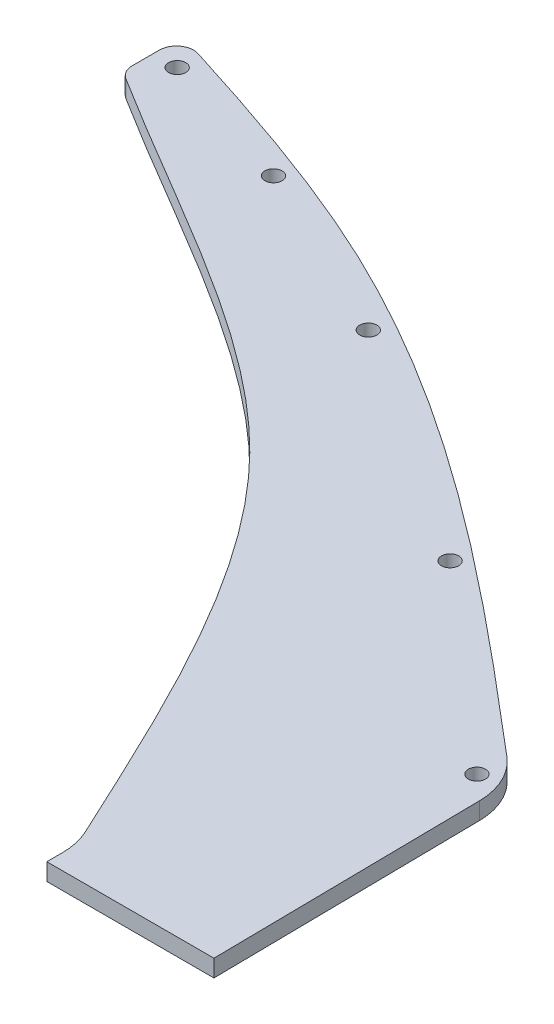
ISO-10303-21;
HEADER;
FILE_DESCRIPTION(('STEP AP214'),'2;1');
FILE_NAME('part.step','',(''),(''),'','','');
FILE_SCHEMA(('AUTOMOTIVE_DESIGN { 1 0 10303 214 1 1 1 1 }'));
ENDSEC;
DATA;
#1=APPLICATION_CONTEXT('core data for automotive mechanical design processes');
#2=APPLICATION_PROTOCOL_DEFINITION('international standard','automotive_design',2000,#1);
#3=PRODUCT_CONTEXT('',#1,'mechanical');
#4=PRODUCT('Part','Part','',(#3));
#5=PRODUCT_RELATED_PRODUCT_CATEGORY('part','',(#4));
#6=PRODUCT_DEFINITION_FORMATION('','',#4);
#7=PRODUCT_DEFINITION_CONTEXT('part definition',#1,'design');
#8=PRODUCT_DEFINITION('design','',#6,#7);
#9=PRODUCT_DEFINITION_SHAPE('','',#8);
#10=(LENGTH_UNIT() NAMED_UNIT(*) SI_UNIT(.MILLI.,.METRE.));
#11=(NAMED_UNIT(*) PLANE_ANGLE_UNIT() SI_UNIT($,.RADIAN.));
#12=(NAMED_UNIT(*) SI_UNIT($,.STERADIAN.) SOLID_ANGLE_UNIT());
#13=UNCERTAINTY_MEASURE_WITH_UNIT(LENGTH_MEASURE(1.E-05),#10,'distance_accuracy_value','');
#14=(GEOMETRIC_REPRESENTATION_CONTEXT(3) GLOBAL_UNCERTAINTY_ASSIGNED_CONTEXT((#13)) GLOBAL_UNIT_ASSIGNED_CONTEXT((#10,
#11,#12)) REPRESENTATION_CONTEXT('',''));
#15=CARTESIAN_POINT('',(0.,0.,0.));
#16=DIRECTION('',(0.,0.,1.));
#17=DIRECTION('',(1.,0.,0.));
#18=AXIS2_PLACEMENT_3D('',#15,#16,#17);
#19=CARTESIAN_POINT('',(2.49554974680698,6.35,-93.2463506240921));
#20=CARTESIAN_POINT('',(-57.8484679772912,6.35,-144.564441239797));
#21=CARTESIAN_POINT('',(-143.955859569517,6.35,-216.062245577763));
#22=CARTESIAN_POINT('',(-248.917518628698,6.35,-251.686521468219));
#23=CARTESIAN_POINT('',(-280.025664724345,6.35,-261.481050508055));
#24=B_SPLINE_CURVE_WITH_KNOTS('',3,(#19,#20,#21,#22,#23),.UNSPECIFIED.,.F.,.F.,(4,1,4),
(0.0308642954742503,0.666306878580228,0.930191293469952),.UNSPECIFIED.);
#25=DIRECTION('',(0.,-1.,0.));
#26=VECTOR('',#25,1.);
#27=SURFACE_OF_LINEAR_EXTRUSION('',#24,#26);
#28=CARTESIAN_POINT('',(2.49554974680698,0.,-93.2463506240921));
#29=CARTESIAN_POINT('',(-57.8484679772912,0.,-144.564441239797));
#30=CARTESIAN_POINT('',(-143.955859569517,0.,-216.062245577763));
#31=CARTESIAN_POINT('',(-248.917518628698,0.,-251.686521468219));
#32=CARTESIAN_POINT('',(-280.025664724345,0.,-261.481050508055));
#33=B_SPLINE_CURVE_WITH_KNOTS('',3,(#28,#29,#30,#31,#32),.UNSPECIFIED.,.F.,.F.,(4,1,4),
(0.0308642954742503,0.666306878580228,0.930191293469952),.UNSPECIFIED.);
#34=CARTESIAN_POINT('',(2.49554974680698,0.,-93.2463506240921));
#35=VERTEX_POINT('',#34);
#36=CARTESIAN_POINT('',(-280.025664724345,0.,-261.481050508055));
#37=VERTEX_POINT('',#36);
#38=EDGE_CURVE('E139',#35,#37,#33,.T.);
#39=ORIENTED_EDGE('',*,*,#38,.T.);
#40=DIRECTION('',(0.,-1.,0.));
#41=VECTOR('',#40,1.);
#42=CARTESIAN_POINT('',(-280.025664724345,6.35,-261.481050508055));
#43=LINE('',#42,#41);
#44=CARTESIAN_POINT('',(-280.025664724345,6.35,-261.481050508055));
#45=VERTEX_POINT('',#44);
#46=EDGE_CURVE('E11',#45,#37,#43,.T.);
#47=ORIENTED_EDGE('',*,*,#46,.F.);
#48=CARTESIAN_POINT('',(2.49554974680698,6.35,-93.2463506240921));
#49=VERTEX_POINT('',#48);
#50=EDGE_CURVE('E169',#49,#45,#24,.T.);
#51=ORIENTED_EDGE('',*,*,#50,.F.);
#52=DIRECTION('',(0.,-1.,0.));
#53=VECTOR('',#52,1.);
#54=CARTESIAN_POINT('',(2.49554974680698,6.35,-93.2463506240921));
#55=LINE('',#54,#53);
#56=EDGE_CURVE('E135',#49,#35,#55,.T.);
#57=ORIENTED_EDGE('',*,*,#56,.T.);
#58=EDGE_LOOP('',(#39,#47,#51,#57));
#59=FACE_BOUND('',#58,.T.);
#60=ADVANCED_FACE('F31',(#59),#27,.F.);
#61=CARTESIAN_POINT('',(-281.9326968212,6.35,-255.424176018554));
#62=DIRECTION('',(0.,-1.,0.));
#63=DIRECTION('',(0.,0.,-1.));
#64=AXIS2_PLACEMENT_3D('',#61,#62,#63);
#65=CYLINDRICAL_SURFACE('',#64,6.35000000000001);
#66=CARTESIAN_POINT('',(-281.9326968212,0.,-255.424176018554));
#67=DIRECTION('',(0.,1.,0.));
#68=DIRECTION('',(0.,0.,1.));
#69=AXIS2_PLACEMENT_3D('',#66,#67,#68);
#70=CIRCLE('',#69,6.35000000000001);
#71=CARTESIAN_POINT('',(-288.2826968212,0.,-255.424176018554));
#72=VERTEX_POINT('',#71);
#73=EDGE_CURVE('E144',#37,#72,#70,.T.);
#74=ORIENTED_EDGE('',*,*,#73,.T.);
#75=DIRECTION('',(0.,-1.,0.));
#76=VECTOR('',#75,1.);
#77=CARTESIAN_POINT('',(-288.2826968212,6.35,-255.424176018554));
#78=LINE('',#77,#76);
#79=CARTESIAN_POINT('',(-288.2826968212,6.35,-255.424176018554));
#80=VERTEX_POINT('',#79);
#81=EDGE_CURVE('E40',#80,#72,#78,.T.);
#82=ORIENTED_EDGE('',*,*,#81,.F.);
#83=CARTESIAN_POINT('',(-281.9326968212,6.35,-255.424176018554));
#84=DIRECTION('',(0.,1.,0.));
#85=DIRECTION('',(0.,0.,1.));
#86=AXIS2_PLACEMENT_3D('',#83,#84,#85);
#87=CIRCLE('',#86,6.35000000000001);
#88=EDGE_CURVE('E97',#45,#80,#87,.T.);
#89=ORIENTED_EDGE('',*,*,#88,.F.);
#90=ORIENTED_EDGE('',*,*,#46,.T.);
#91=EDGE_LOOP('',(#74,#82,#89,#90));
#92=FACE_BOUND('',#91,.T.);
#93=ADVANCED_FACE('F228',(#92),#65,.T.);
#94=CARTESIAN_POINT('',(-288.2826968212,6.35,-245.445848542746));
#95=DIRECTION('',(1.,0.,0.));
#96=DIRECTION('',(0.,0.,-1.));
#97=AXIS2_PLACEMENT_3D('',#94,#95,#96);
#98=PLANE('',#97);
#99=DIRECTION('',(0.,0.,1.));
#100=VECTOR('',#99,1.);
#101=CARTESIAN_POINT('',(-288.2826968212,0.,-245.445848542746));
#102=LINE('',#101,#100);
#103=CARTESIAN_POINT('',(-288.2826968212,0.,-245.445848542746));
#104=VERTEX_POINT('',#103);
#105=EDGE_CURVE('E150',#72,#104,#102,.T.);
#106=ORIENTED_EDGE('',*,*,#105,.T.);
#107=DIRECTION('',(0.,-1.,0.));
#108=VECTOR('',#107,1.);
#109=CARTESIAN_POINT('',(-288.2826968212,6.35,-245.445848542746));
#110=LINE('',#109,#108);
#111=CARTESIAN_POINT('',(-288.2826968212,6.35,-245.445848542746));
#112=VERTEX_POINT('',#111);
#113=EDGE_CURVE('E182',#112,#104,#110,.T.);
#114=ORIENTED_EDGE('',*,*,#113,.F.);
#115=DIRECTION('',(0.,0.,1.));
#116=VECTOR('',#115,1.);
#117=CARTESIAN_POINT('',(-288.2826968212,6.35,-245.445848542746));
#118=LINE('',#117,#116);
#119=EDGE_CURVE('E190',#80,#112,#118,.T.);
#120=ORIENTED_EDGE('',*,*,#119,.F.);
#121=ORIENTED_EDGE('',*,*,#81,.T.);
#122=EDGE_LOOP('',(#106,#114,#120,#121));
#123=FACE_BOUND('',#122,.T.);
#124=ADVANCED_FACE('F188',(#123),#98,.F.);
#125=CARTESIAN_POINT('',(-281.9326968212,6.35,-245.445848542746));
#126=DIRECTION('',(0.,-1.,0.));
#127=DIRECTION('',(0.,0.,-1.));
#128=AXIS2_PLACEMENT_3D('',#125,#126,#127);
#129=CYLINDRICAL_SURFACE('',#128,6.35000000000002);
#130=CARTESIAN_POINT('',(-281.9326968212,0.,-245.445848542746));
#131=DIRECTION('',(0.,1.,0.));
#132=DIRECTION('',(0.,0.,-1.));
#133=AXIS2_PLACEMENT_3D('',#130,#131,#132);
#134=CIRCLE('',#133,6.35000000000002);
#135=CARTESIAN_POINT('',(-285.320152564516,0.,-240.074848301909));
#136=VERTEX_POINT('',#135);
#137=EDGE_CURVE('E152',#104,#136,#134,.T.);
#138=ORIENTED_EDGE('',*,*,#137,.T.);
#139=DIRECTION('',(0.,-1.,0.));
#140=VECTOR('',#139,1.);
#141=CARTESIAN_POINT('',(-285.320152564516,6.35,-240.074848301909));
#142=LINE('',#141,#140);
#143=CARTESIAN_POINT('',(-285.320152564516,6.35,-240.074848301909));
#144=VERTEX_POINT('',#143);
#145=EDGE_CURVE('E179',#144,#136,#142,.T.);
#146=ORIENTED_EDGE('',*,*,#145,.F.);
#147=CARTESIAN_POINT('',(-281.9326968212,6.35,-245.445848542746));
#148=DIRECTION('',(0.,1.,0.));
#149=DIRECTION('',(0.,0.,-1.));
#150=AXIS2_PLACEMENT_3D('',#147,#148,#149);
#151=CIRCLE('',#150,6.35000000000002);
#152=EDGE_CURVE('E208',#112,#144,#151,.T.);
#153=ORIENTED_EDGE('',*,*,#152,.F.);
#154=ORIENTED_EDGE('',*,*,#113,.T.);
#155=EDGE_LOOP('',(#138,#146,#153,#154));
#156=FACE_BOUND('',#155,.T.);
#157=ADVANCED_FACE('F199',(#156),#129,.T.);
#158=CARTESIAN_POINT('',(-285.320152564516,6.35,-240.074848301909));
#159=CARTESIAN_POINT('',(-243.910194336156,6.35,-213.957850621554));
#160=CARTESIAN_POINT('',(-187.46880956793,6.35,-185.164837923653));
#161=CARTESIAN_POINT('',(-106.059505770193,6.35,-110.100776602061));
#162=CARTESIAN_POINT('',(-75.6970904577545,6.35,-43.0783085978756));
#163=CARTESIAN_POINT('',(-51.457853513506,6.35,8.85872645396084));
#164=B_SPLINE_CURVE_WITH_KNOTS('',3,(#158,#159,#160,#161,#162,#163),.UNSPECIFIED.,.F.,.F.,(4,1,
1,4),(0.0154528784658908,0.420393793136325,0.51775815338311,0.989096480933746),.UNSPECIFIED.);
#165=DIRECTION('',(0.,-1.,0.));
#166=VECTOR('',#165,1.);
#167=SURFACE_OF_LINEAR_EXTRUSION('',#164,#166);
#168=CARTESIAN_POINT('',(-285.320152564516,0.,-240.074848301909));
#169=CARTESIAN_POINT('',(-243.910194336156,0.,-213.957850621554));
#170=CARTESIAN_POINT('',(-187.46880956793,0.,-185.164837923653));
#171=CARTESIAN_POINT('',(-106.059505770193,0.,-110.100776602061));
#172=CARTESIAN_POINT('',(-75.6970904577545,0.,-43.0783085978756));
#173=CARTESIAN_POINT('',(-51.457853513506,0.,8.85872645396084));
#174=B_SPLINE_CURVE_WITH_KNOTS('',3,(#168,#169,#170,#171,#172,#173),.UNSPECIFIED.,.F.,.F.,(4,1,
1,4),(0.0154528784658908,0.420393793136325,0.51775815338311,0.989096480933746),.UNSPECIFIED.);
#175=CARTESIAN_POINT('',(-51.457853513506,0.,8.85872645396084));
#176=VERTEX_POINT('',#175);
#177=EDGE_CURVE('E154',#136,#176,#174,.T.);
#178=ORIENTED_EDGE('',*,*,#177,.T.);
#179=DIRECTION('',(0.,-1.,0.));
#180=VECTOR('',#179,1.);
#181=CARTESIAN_POINT('',(-51.457853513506,6.35,8.85872645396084));
#182=LINE('',#181,#180);
#183=CARTESIAN_POINT('',(-51.457853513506,6.35,8.85872645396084));
#184=VERTEX_POINT('',#183);
#185=EDGE_CURVE('E176',#184,#176,#182,.T.);
#186=ORIENTED_EDGE('',*,*,#185,.F.);
#187=EDGE_CURVE('E205',#144,#184,#164,.T.);
#188=ORIENTED_EDGE('',*,*,#187,.F.);
#189=ORIENTED_EDGE('',*,*,#145,.T.);
#190=EDGE_LOOP('',(#178,#186,#188,#189));
#191=FACE_BOUND('',#190,.T.);
#192=ADVANCED_FACE('F203',(#191),#167,.F.);
#193=CARTESIAN_POINT('',(-74.4745734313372,6.35,19.600728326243));
#194=DIRECTION('',(0.,-1.,0.));
#195=DIRECTION('',(0.,0.,-1.));
#196=AXIS2_PLACEMENT_3D('',#193,#194,#195);
#197=CYLINDRICAL_SURFACE('',#196,25.4);
#198=CARTESIAN_POINT('',(-74.4745734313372,0.,19.600728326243));
#199=DIRECTION('',(0.,-1.,0.));
#200=DIRECTION('',(0.,0.,1.));
#201=AXIS2_PLACEMENT_3D('',#198,#199,#200);
#202=CIRCLE('',#201,25.4);
#203=CARTESIAN_POINT('',(-49.0745734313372,0.,19.600728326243));
#204=VERTEX_POINT('',#203);
#205=EDGE_CURVE('E158',#176,#204,#202,.T.);
#206=ORIENTED_EDGE('',*,*,#205,.T.);
#207=DIRECTION('',(0.,-1.,0.));
#208=VECTOR('',#207,1.);
#209=CARTESIAN_POINT('',(-49.0745734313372,6.35,19.600728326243));
#210=LINE('',#209,#208);
#211=CARTESIAN_POINT('',(-49.0745734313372,6.35,19.600728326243));
#212=VERTEX_POINT('',#211);
#213=EDGE_CURVE('E173',#212,#204,#210,.T.);
#214=ORIENTED_EDGE('',*,*,#213,.F.);
#215=CARTESIAN_POINT('',(-74.4745734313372,6.35,19.600728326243));
#216=DIRECTION('',(0.,-1.,0.));
#217=DIRECTION('',(0.,0.,1.));
#218=AXIS2_PLACEMENT_3D('',#215,#216,#217);
#219=CIRCLE('',#218,25.4);
#220=EDGE_CURVE('E207',#184,#212,#219,.T.);
#221=ORIENTED_EDGE('',*,*,#220,.F.);
#222=ORIENTED_EDGE('',*,*,#185,.T.);
#223=EDGE_LOOP('',(#206,#214,#221,#222));
#224=FACE_BOUND('',#223,.T.);
#225=ADVANCED_FACE('F223',(#224),#197,.F.);
#226=CARTESIAN_POINT('',(-49.0745734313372,6.35,19.600728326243));
#227=DIRECTION('',(1.,0.,0.));
#228=DIRECTION('',(0.,0.,-1.));
#229=AXIS2_PLACEMENT_3D('',#226,#227,#228);
#230=PLANE('',#229);
#231=DIRECTION('',(0.,0.,1.));
#232=VECTOR('',#231,1.);
#233=CARTESIAN_POINT('',(-49.0745734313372,0.,19.600728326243));
#234=LINE('',#233,#232);
#235=CARTESIAN_POINT('',(-49.0745734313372,0.,25.403057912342));
#236=VERTEX_POINT('',#235);
#237=EDGE_CURVE('E163',#204,#236,#234,.T.);
#238=ORIENTED_EDGE('',*,*,#237,.T.);
#239=DIRECTION('',(0.,-1.,0.));
#240=VECTOR('',#239,1.);
#241=CARTESIAN_POINT('',(-49.0745734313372,6.35,25.403057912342));
#242=LINE('',#241,#240);
#243=CARTESIAN_POINT('',(-49.0745734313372,6.35,25.403057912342));
#244=VERTEX_POINT('',#243);
#245=EDGE_CURVE('E130',#244,#236,#242,.T.);
#246=ORIENTED_EDGE('',*,*,#245,.F.);
#247=DIRECTION('',(0.,0.,1.));
#248=VECTOR('',#247,1.);
#249=CARTESIAN_POINT('',(-49.0745734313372,6.35,19.600728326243));
#250=LINE('',#249,#248);
#251=EDGE_CURVE('E122',#212,#244,#250,.T.);
#252=ORIENTED_EDGE('',*,*,#251,.F.);
#253=ORIENTED_EDGE('',*,*,#213,.T.);
#254=EDGE_LOOP('',(#238,#246,#252,#253));
#255=FACE_BOUND('',#254,.T.);
#256=ADVANCED_FACE('F238',(#255),#230,.F.);
#257=CARTESIAN_POINT('',(-12.6572245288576,6.35,25.403057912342));
#258=DIRECTION('',(0.,0.,-1.));
#259=DIRECTION('',(-1.,0.,0.));
#260=AXIS2_PLACEMENT_3D('',#257,#258,#259);
#261=PLANE('',#260);
#262=DIRECTION('',(1.,0.,0.));
#263=VECTOR('',#262,1.);
#264=CARTESIAN_POINT('',(-12.6572245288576,0.,25.403057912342));
#265=LINE('',#264,#263);
#266=CARTESIAN_POINT('',(12.750182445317,0.,25.403057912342));
#267=VERTEX_POINT('',#266);
#268=EDGE_CURVE('E129',#236,#267,#265,.T.);
#269=ORIENTED_EDGE('',*,*,#268,.T.);
#270=DIRECTION('',(0.,-1.,0.));
#271=VECTOR('',#270,1.);
#272=CARTESIAN_POINT('',(12.750182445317,6.35,25.403057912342));
#273=LINE('',#272,#271);
#274=CARTESIAN_POINT('',(12.750182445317,6.35,25.403057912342));
#275=VERTEX_POINT('',#274);
#276=EDGE_CURVE('E127',#275,#267,#273,.T.);
#277=ORIENTED_EDGE('',*,*,#276,.F.);
#278=DIRECTION('',(1.,0.,0.));
#279=VECTOR('',#278,1.);
#280=CARTESIAN_POINT('',(-49.0745734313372,6.35,25.403057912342));
#281=LINE('',#280,#279);
#282=EDGE_CURVE('E116',#244,#275,#281,.T.);
#283=ORIENTED_EDGE('',*,*,#282,.F.);
#284=ORIENTED_EDGE('',*,*,#245,.T.);
#285=EDGE_LOOP('',(#269,#277,#283,#284));
#286=FACE_BOUND('',#285,.T.);
#287=ADVANCED_FACE('F128',(#286),#261,.F.);
#288=CARTESIAN_POINT('',(12.750182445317,6.35,25.403057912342));
#289=DIRECTION('',(-0.99991332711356,0.,0.0131657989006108));
#290=DIRECTION('',(0.0131657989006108,0.,0.99991332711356));
#291=AXIS2_PLACEMENT_3D('',#288,#289,#290);
#292=PLANE('',#291);
#293=DIRECTION('',(-0.0131657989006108,0.,-0.99991332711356));
#294=VECTOR('',#293,1.);
#295=CARTESIAN_POINT('',(12.750182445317,0.,25.403057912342));
#296=LINE('',#295,#294);
#297=CARTESIAN_POINT('',(11.4382993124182,0.,-74.231566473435));
#298=VERTEX_POINT('',#297);
#299=EDGE_CURVE('E83',#267,#298,#296,.T.);
#300=ORIENTED_EDGE('',*,*,#299,.T.);
#301=DIRECTION('',(0.,-1.,0.));
#302=VECTOR('',#301,1.);
#303=CARTESIAN_POINT('',(11.4382993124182,6.35,-74.231566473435));
#304=LINE('',#303,#302);
#305=CARTESIAN_POINT('',(11.4382993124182,6.35,-74.231566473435));
#306=VERTEX_POINT('',#305);
#307=EDGE_CURVE('E131',#306,#298,#304,.T.);
#308=ORIENTED_EDGE('',*,*,#307,.F.);
#309=DIRECTION('',(-0.0131657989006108,0.,-0.99991332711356));
#310=VECTOR('',#309,1.);
#311=CARTESIAN_POINT('',(12.750182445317,6.35,25.403057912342));
#312=LINE('',#311,#310);
#313=EDGE_CURVE('E120',#275,#306,#312,.T.);
#314=ORIENTED_EDGE('',*,*,#313,.F.);
#315=ORIENTED_EDGE('',*,*,#276,.T.);
#316=EDGE_LOOP('',(#300,#308,#314,#315));
#317=FACE_BOUND('',#316,.T.);
#318=ADVANCED_FACE('F133',(#317),#292,.F.);
#319=CARTESIAN_POINT('',(-13.9594991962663,6.35,-73.8971551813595));
#320=DIRECTION('',(0.,-1.,0.));
#321=DIRECTION('',(0.,0.,-1.));
#322=AXIS2_PLACEMENT_3D('',#319,#320,#321);
#323=CYLINDRICAL_SURFACE('',#322,25.4);
#324=CARTESIAN_POINT('',(-13.9594991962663,0.,-73.8971551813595));
#325=DIRECTION('',(0.,1.,0.));
#326=DIRECTION('',(0.,0.,1.));
#327=AXIS2_PLACEMENT_3D('',#324,#325,#326);
#328=CIRCLE('',#327,25.4);
#329=EDGE_CURVE('E89',#298,#35,#328,.T.);
#330=ORIENTED_EDGE('',*,*,#329,.T.);
#331=ORIENTED_EDGE('',*,*,#56,.F.);
#332=CARTESIAN_POINT('',(-13.9594991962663,6.35,-73.8971551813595));
#333=DIRECTION('',(0.,1.,0.));
#334=DIRECTION('',(0.,0.,1.));
#335=AXIS2_PLACEMENT_3D('',#332,#333,#334);
#336=CIRCLE('',#335,25.4);
#337=EDGE_CURVE('E48',#306,#49,#336,.T.);
#338=ORIENTED_EDGE('',*,*,#337,.F.);
#339=ORIENTED_EDGE('',*,*,#307,.T.);
#340=EDGE_LOOP('',(#330,#331,#338,#339));
#341=FACE_BOUND('',#340,.T.);
#342=ADVANCED_FACE('F252',(#341),#323,.T.);
#343=CARTESIAN_POINT('',(-129.516096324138,6.35,-194.926188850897));
#344=DIRECTION('',(0.,-1.,0.));
#345=DIRECTION('',(0.,0.,-1.));
#346=AXIS2_PLACEMENT_3D('',#343,#344,#345);
#347=PLANE('',#346);
#348=CARTESIAN_POINT('',(-226.891855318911,6.35,-236.255776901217));
#349=DIRECTION('',(0.,1.,0.));
#350=DIRECTION('',(0.,0.,1.));
#351=AXIS2_PLACEMENT_3D('',#348,#349,#350);
#352=CIRCLE('',#351,3.18135000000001);
#353=CARTESIAN_POINT('',(-226.891855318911,6.35,-233.074426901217));
#354=VERTEX_POINT('',#353);
#355=EDGE_CURVE('E288',#354,#354,#352,.T.);
#356=ORIENTED_EDGE('',*,*,#355,.F.);
#357=EDGE_LOOP('',(#356));
#358=FACE_BOUND('',#357,.T.);
#359=CARTESIAN_POINT('',(-159.936390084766,6.35,-204.38643865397));
#360=DIRECTION('',(0.,1.,0.));
#361=DIRECTION('',(0.,0.,1.));
#362=AXIS2_PLACEMENT_3D('',#359,#360,#361);
#363=CIRCLE('',#362,3.18135000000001);
#364=CARTESIAN_POINT('',(-159.936390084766,6.35,-201.20508865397));
#365=VERTEX_POINT('',#364);
#366=EDGE_CURVE('E290',#365,#365,#363,.T.);
#367=ORIENTED_EDGE('',*,*,#366,.F.);
#368=EDGE_LOOP('',(#367));
#369=FACE_BOUND('',#368,.T.);
#370=CARTESIAN_POINT('',(-70.8638343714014,6.35,-145.5785908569));
#371=DIRECTION('',(0.,1.,0.));
#372=DIRECTION('',(0.,0.,1.));
#373=AXIS2_PLACEMENT_3D('',#370,#371,#372);
#374=CIRCLE('',#373,3.18135);
#375=CARTESIAN_POINT('',(-70.8638343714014,6.35,-142.3972408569));
#376=VERTEX_POINT('',#375);
#377=EDGE_CURVE('E296',#376,#376,#374,.T.);
#378=ORIENTED_EDGE('',*,*,#377,.F.);
#379=EDGE_LOOP('',(#378));
#380=FACE_BOUND('',#379,.T.);
#381=CARTESIAN_POINT('',(2.42519565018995,6.35,-82.2078729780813));
#382=DIRECTION('',(0.,1.,0.));
#383=DIRECTION('',(0.,0.,1.));
#384=AXIS2_PLACEMENT_3D('',#381,#382,#383);
#385=CIRCLE('',#384,3.18135);
#386=CARTESIAN_POINT('',(2.42519565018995,6.35,-79.0265229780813));
#387=VERTEX_POINT('',#386);
#388=EDGE_CURVE('E302',#387,#387,#385,.T.);
#389=ORIENTED_EDGE('',*,*,#388,.F.);
#390=EDGE_LOOP('',(#389));
#391=FACE_BOUND('',#390,.T.);
#392=CARTESIAN_POINT('',(-279.379146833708,6.35,-253.126748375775));
#393=DIRECTION('',(0.,1.,0.));
#394=DIRECTION('',(0.,0.,1.));
#395=AXIS2_PLACEMENT_3D('',#392,#393,#394);
#396=CIRCLE('',#395,3.18135000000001);
#397=CARTESIAN_POINT('',(-279.379146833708,6.35,-249.945398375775));
#398=VERTEX_POINT('',#397);
#399=EDGE_CURVE('E308',#398,#398,#396,.T.);
#400=ORIENTED_EDGE('',*,*,#399,.F.);
#401=EDGE_LOOP('',(#400));
#402=FACE_BOUND('',#401,.T.);
#403=ORIENTED_EDGE('',*,*,#50,.T.);
#404=ORIENTED_EDGE('',*,*,#88,.T.);
#405=ORIENTED_EDGE('',*,*,#119,.T.);
#406=ORIENTED_EDGE('',*,*,#152,.T.);
#407=ORIENTED_EDGE('',*,*,#187,.T.);
#408=ORIENTED_EDGE('',*,*,#220,.T.);
#409=ORIENTED_EDGE('',*,*,#251,.T.);
#410=ORIENTED_EDGE('',*,*,#282,.T.);
#411=ORIENTED_EDGE('',*,*,#313,.T.);
#412=ORIENTED_EDGE('',*,*,#337,.T.);
#413=EDGE_LOOP('',(#403,#404,#405,#406,#407,#408,#409,#410,#411,#412));
#414=FACE_BOUND('',#413,.T.);
#415=ADVANCED_FACE('F118',(#358,#369,#380,#391,#402,#414),#347,.F.);
#416=CARTESIAN_POINT('',(-129.516096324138,0.,-194.926188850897));
#417=DIRECTION('',(0.,-1.,0.));
#418=DIRECTION('',(0.,0.,-1.));
#419=AXIS2_PLACEMENT_3D('',#416,#417,#418);
#420=PLANE('',#419);
#421=CARTESIAN_POINT('',(-226.891855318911,0.,-236.255776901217));
#422=DIRECTION('',(0.,1.,0.));
#423=DIRECTION('',(0.,0.,1.));
#424=AXIS2_PLACEMENT_3D('',#421,#422,#423);
#425=CIRCLE('',#424,3.18135000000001);
#426=CARTESIAN_POINT('',(-226.891855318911,0.,-233.074426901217));
#427=VERTEX_POINT('',#426);
#428=EDGE_CURVE('E285',#427,#427,#425,.T.);
#429=ORIENTED_EDGE('',*,*,#428,.T.);
#430=EDGE_LOOP('',(#429));
#431=FACE_BOUND('',#430,.T.);
#432=CARTESIAN_POINT('',(-159.936390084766,0.,-204.38643865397));
#433=DIRECTION('',(0.,1.,0.));
#434=DIRECTION('',(0.,0.,1.));
#435=AXIS2_PLACEMENT_3D('',#432,#433,#434);
#436=CIRCLE('',#435,3.18135000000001);
#437=CARTESIAN_POINT('',(-159.936390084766,0.,-201.20508865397));
#438=VERTEX_POINT('',#437);
#439=EDGE_CURVE('E293',#438,#438,#436,.T.);
#440=ORIENTED_EDGE('',*,*,#439,.T.);
#441=EDGE_LOOP('',(#440));
#442=FACE_BOUND('',#441,.T.);
#443=CARTESIAN_POINT('',(-70.8638343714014,0.,-145.5785908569));
#444=DIRECTION('',(0.,1.,0.));
#445=DIRECTION('',(0.,0.,1.));
#446=AXIS2_PLACEMENT_3D('',#443,#444,#445);
#447=CIRCLE('',#446,3.18135);
#448=CARTESIAN_POINT('',(-70.8638343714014,0.,-142.3972408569));
#449=VERTEX_POINT('',#448);
#450=EDGE_CURVE('E299',#449,#449,#447,.T.);
#451=ORIENTED_EDGE('',*,*,#450,.T.);
#452=EDGE_LOOP('',(#451));
#453=FACE_BOUND('',#452,.T.);
#454=CARTESIAN_POINT('',(2.42519565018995,0.,-82.2078729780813));
#455=DIRECTION('',(0.,1.,0.));
#456=DIRECTION('',(0.,0.,1.));
#457=AXIS2_PLACEMENT_3D('',#454,#455,#456);
#458=CIRCLE('',#457,3.18135);
#459=CARTESIAN_POINT('',(2.42519565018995,0.,-79.0265229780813));
#460=VERTEX_POINT('',#459);
#461=EDGE_CURVE('E305',#460,#460,#458,.T.);
#462=ORIENTED_EDGE('',*,*,#461,.T.);
#463=EDGE_LOOP('',(#462));
#464=FACE_BOUND('',#463,.T.);
#465=CARTESIAN_POINT('',(-279.379146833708,0.,-253.126748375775));
#466=DIRECTION('',(0.,1.,0.));
#467=DIRECTION('',(0.,0.,1.));
#468=AXIS2_PLACEMENT_3D('',#465,#466,#467);
#469=CIRCLE('',#468,3.18135000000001);
#470=CARTESIAN_POINT('',(-279.379146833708,0.,-249.945398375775));
#471=VERTEX_POINT('',#470);
#472=EDGE_CURVE('E145',#471,#471,#469,.T.);
#473=ORIENTED_EDGE('',*,*,#472,.T.);
#474=EDGE_LOOP('',(#473));
#475=FACE_BOUND('',#474,.T.);
#476=ORIENTED_EDGE('',*,*,#38,.F.);
#477=ORIENTED_EDGE('',*,*,#329,.F.);
#478=ORIENTED_EDGE('',*,*,#299,.F.);
#479=ORIENTED_EDGE('',*,*,#268,.F.);
#480=ORIENTED_EDGE('',*,*,#237,.F.);
#481=ORIENTED_EDGE('',*,*,#205,.F.);
#482=ORIENTED_EDGE('',*,*,#177,.F.);
#483=ORIENTED_EDGE('',*,*,#137,.F.);
#484=ORIENTED_EDGE('',*,*,#105,.F.);
#485=ORIENTED_EDGE('',*,*,#73,.F.);
#486=EDGE_LOOP('',(#476,#477,#478,#479,#480,#481,#482,#483,#484,#485));
#487=FACE_BOUND('',#486,.T.);
#488=ADVANCED_FACE('F194',(#431,#442,#453,#464,#475,#487),#420,.T.);
#489=CARTESIAN_POINT('',(-279.379146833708,0.,-253.126748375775));
#490=DIRECTION('',(0.,1.,0.));
#491=DIRECTION('',(0.,0.,1.));
#492=AXIS2_PLACEMENT_3D('',#489,#490,#491);
#493=CYLINDRICAL_SURFACE('',#492,3.18135000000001);
#494=ORIENTED_EDGE('',*,*,#472,.F.);
#495=EDGE_LOOP('',(#494));
#496=FACE_BOUND('',#495,.T.);
#497=ORIENTED_EDGE('',*,*,#399,.T.);
#498=EDGE_LOOP('',(#497));
#499=FACE_BOUND('',#498,.T.);
#500=ADVANCED_FACE('F257',(#496,#499),#493,.F.);
#501=CARTESIAN_POINT('',(2.42519565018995,0.,-82.2078729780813));
#502=DIRECTION('',(0.,1.,0.));
#503=DIRECTION('',(0.,0.,1.));
#504=AXIS2_PLACEMENT_3D('',#501,#502,#503);
#505=CYLINDRICAL_SURFACE('',#504,3.18135);
#506=ORIENTED_EDGE('',*,*,#461,.F.);
#507=EDGE_LOOP('',(#506));
#508=FACE_BOUND('',#507,.T.);
#509=ORIENTED_EDGE('',*,*,#388,.T.);
#510=EDGE_LOOP('',(#509));
#511=FACE_BOUND('',#510,.T.);
#512=ADVANCED_FACE('F264',(#508,#511),#505,.F.);
#513=CARTESIAN_POINT('',(-70.8638343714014,0.,-145.5785908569));
#514=DIRECTION('',(0.,1.,0.));
#515=DIRECTION('',(0.,0.,1.));
#516=AXIS2_PLACEMENT_3D('',#513,#514,#515);
#517=CYLINDRICAL_SURFACE('',#516,3.18135);
#518=ORIENTED_EDGE('',*,*,#450,.F.);
#519=EDGE_LOOP('',(#518));
#520=FACE_BOUND('',#519,.T.);
#521=ORIENTED_EDGE('',*,*,#377,.T.);
#522=EDGE_LOOP('',(#521));
#523=FACE_BOUND('',#522,.T.);
#524=ADVANCED_FACE('F268',(#520,#523),#517,.F.);
#525=CARTESIAN_POINT('',(-159.936390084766,0.,-204.38643865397));
#526=DIRECTION('',(0.,1.,0.));
#527=DIRECTION('',(0.,0.,1.));
#528=AXIS2_PLACEMENT_3D('',#525,#526,#527);
#529=CYLINDRICAL_SURFACE('',#528,3.18135000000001);
#530=ORIENTED_EDGE('',*,*,#439,.F.);
#531=EDGE_LOOP('',(#530));
#532=FACE_BOUND('',#531,.T.);
#533=ORIENTED_EDGE('',*,*,#366,.T.);
#534=EDGE_LOOP('',(#533));
#535=FACE_BOUND('',#534,.T.);
#536=ADVANCED_FACE('F272',(#532,#535),#529,.F.);
#537=CARTESIAN_POINT('',(-226.891855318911,0.,-236.255776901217));
#538=DIRECTION('',(0.,1.,0.));
#539=DIRECTION('',(0.,0.,1.));
#540=AXIS2_PLACEMENT_3D('',#537,#538,#539);
#541=CYLINDRICAL_SURFACE('',#540,3.18135000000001);
#542=ORIENTED_EDGE('',*,*,#428,.F.);
#543=EDGE_LOOP('',(#542));
#544=FACE_BOUND('',#543,.T.);
#545=ORIENTED_EDGE('',*,*,#355,.T.);
#546=EDGE_LOOP('',(#545));
#547=FACE_BOUND('',#546,.T.);
#548=ADVANCED_FACE('F276',(#544,#547),#541,.F.);
#549=CLOSED_SHELL('',(#60,#93,#124,#157,#192,#225,#256,#287,#318,#342,#415,#488,#500,#512,#524,
#536,#548));
#550=MANIFOLD_SOLID_BREP('B2',#549);
#551=ADVANCED_BREP_SHAPE_REPRESENTATION('',(#18,#550),#14);
#552=SHAPE_DEFINITION_REPRESENTATION(#9,#551);
ENDSEC;
END-ISO-10303-21;
